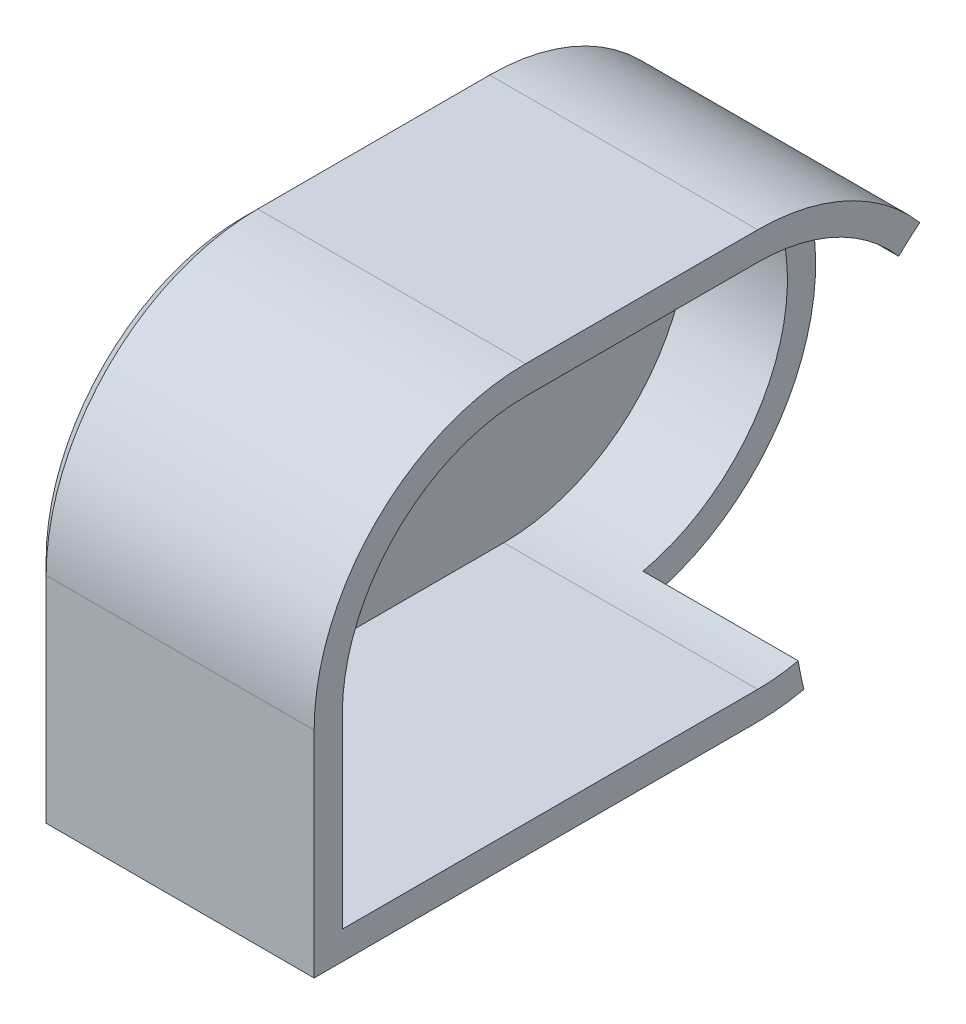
ISO-10303-21;
HEADER;
FILE_DESCRIPTION(('STEP AP214'),'2;1');
FILE_NAME('part.step','',(''),(''),'','','');
FILE_SCHEMA(('AUTOMOTIVE_DESIGN { 1 0 10303 214 1 1 1 1 }'));
ENDSEC;
DATA;
#1=APPLICATION_CONTEXT('core data for automotive mechanical design processes');
#2=APPLICATION_PROTOCOL_DEFINITION('international standard','automotive_design',2000,#1);
#3=PRODUCT_CONTEXT('',#1,'mechanical');
#4=PRODUCT('Part','Part','',(#3));
#5=PRODUCT_RELATED_PRODUCT_CATEGORY('part','',(#4));
#6=PRODUCT_DEFINITION_FORMATION('','',#4);
#7=PRODUCT_DEFINITION_CONTEXT('part definition',#1,'design');
#8=PRODUCT_DEFINITION('design','',#6,#7);
#9=PRODUCT_DEFINITION_SHAPE('','',#8);
#10=(LENGTH_UNIT() NAMED_UNIT(*) SI_UNIT(.MILLI.,.METRE.));
#11=(NAMED_UNIT(*) PLANE_ANGLE_UNIT() SI_UNIT($,.RADIAN.));
#12=(NAMED_UNIT(*) SI_UNIT($,.STERADIAN.) SOLID_ANGLE_UNIT());
#13=UNCERTAINTY_MEASURE_WITH_UNIT(LENGTH_MEASURE(1.E-05),#10,'distance_accuracy_value','');
#14=(GEOMETRIC_REPRESENTATION_CONTEXT(3) GLOBAL_UNCERTAINTY_ASSIGNED_CONTEXT((#13)) GLOBAL_UNIT_ASSIGNED_CONTEXT((#10,
#11,#12)) REPRESENTATION_CONTEXT('',''));
#15=CARTESIAN_POINT('',(0.,0.,0.));
#16=DIRECTION('',(0.,0.,1.));
#17=DIRECTION('',(1.,0.,0.));
#18=AXIS2_PLACEMENT_3D('',#15,#16,#17);
#19=CARTESIAN_POINT('',(-8.,0.,-300.));
#20=DIRECTION('',(-1.,0.,0.));
#21=DIRECTION('',(0.,0.,1.));
#22=AXIS2_PLACEMENT_3D('',#19,#20,#21);
#23=PLANE('',#22);
#24=CARTESIAN_POINT('',(-7.99999999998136,8.88991235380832,-273.448739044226));
#25=DIRECTION('',(-1.,0.,0.));
#26=DIRECTION('',(0.,0.,1.));
#27=AXIS2_PLACEMENT_3D('',#24,#25,#26);
#28=CIRCLE('',#27,15.1100876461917);
#29=CARTESIAN_POINT('',(-8.,18.6927535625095,-284.947393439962));
#30=VERTEX_POINT('',#29);
#31=CARTESIAN_POINT('',(-7.99999999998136,24.,-273.448739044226));
#32=VERTEX_POINT('',#31);
#33=EDGE_CURVE('E223',#30,#32,#28,.F.);
#34=ORIENTED_EDGE('',*,*,#33,.T.);
#35=DIRECTION('',(0.,0.,1.));
#36=VECTOR('',#35,1.);
#37=CARTESIAN_POINT('',(-7.99999999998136,24.,-257.));
#38=LINE('',#37,#36);
#39=CARTESIAN_POINT('',(-7.99999999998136,24.,-257.));
#40=VERTEX_POINT('',#39);
#41=EDGE_CURVE('E219',#32,#40,#38,.T.);
#42=ORIENTED_EDGE('',*,*,#41,.T.);
#43=CARTESIAN_POINT('',(-7.99999999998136,9.00000000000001,-257.));
#44=DIRECTION('',(-1.,0.,0.));
#45=DIRECTION('',(0.,0.,1.));
#46=AXIS2_PLACEMENT_3D('',#43,#44,#45);
#47=CIRCLE('',#46,15.);
#48=CARTESIAN_POINT('',(-7.99999999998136,9.00000000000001,-242.));
#49=VERTEX_POINT('',#48);
#50=EDGE_CURVE('E215',#40,#49,#47,.F.);
#51=ORIENTED_EDGE('',*,*,#50,.T.);
#52=DIRECTION('',(0.,-1.,0.));
#53=VECTOR('',#52,1.);
#54=CARTESIAN_POINT('',(-7.99999999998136,-6.22017529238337,-242.));
#55=LINE('',#54,#53);
#56=CARTESIAN_POINT('',(-7.99999999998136,-6.22017529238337,-242.));
#57=VERTEX_POINT('',#56);
#58=EDGE_CURVE('E237',#49,#57,#55,.T.);
#59=ORIENTED_EDGE('',*,*,#58,.T.);
#60=DIRECTION('',(0.,0.,-1.));
#61=VECTOR('',#60,1.);
#62=CARTESIAN_POINT('',(-7.99999999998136,-6.22017529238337,-273.448739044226));
#63=LINE('',#62,#61);
#64=CARTESIAN_POINT('',(-7.99999999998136,-6.22017529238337,-273.448739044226));
#65=VERTEX_POINT('',#64);
#66=EDGE_CURVE('E234',#57,#65,#63,.T.);
#67=ORIENTED_EDGE('',*,*,#66,.T.);
#68=CARTESIAN_POINT('',(-8.,-5.86037767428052,-276.726496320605));
#69=VERTEX_POINT('',#68);
#70=EDGE_CURVE('E222',#65,#69,#28,.F.);
#71=ORIENTED_EDGE('',*,*,#70,.T.);
#72=CARTESIAN_POINT('',(-8.,0.,-300.));
#73=DIRECTION('',(1.,0.,0.));
#74=DIRECTION('',(0.,0.,1.));
#75=AXIS2_PLACEMENT_3D('',#72,#73,#74);
#76=CIRCLE('',#75,24.);
#77=CARTESIAN_POINT('',(-8.,-3.90204206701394,-276.319331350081));
#78=VERTEX_POINT('',#77);
#79=EDGE_CURVE('E245',#78,#69,#76,.T.);
#80=ORIENTED_EDGE('',*,*,#79,.F.);
#81=CARTESIAN_POINT('',(-7.99999999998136,8.88991235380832,-273.448739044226));
#82=DIRECTION('',(-1.,0.,0.));
#83=DIRECTION('',(0.,0.,1.));
#84=AXIS2_PLACEMENT_3D('',#81,#82,#83);
#85=CIRCLE('',#84,13.1100876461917);
#86=CARTESIAN_POINT('',(-7.99999999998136,-4.22017529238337,-273.448739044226));
#87=VERTEX_POINT('',#86);
#88=EDGE_CURVE('E214',#87,#78,#85,.F.);
#89=ORIENTED_EDGE('',*,*,#88,.F.);
#90=DIRECTION('',(0.,0.,-1.));
#91=VECTOR('',#90,1.);
#92=CARTESIAN_POINT('',(-7.99999999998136,-4.22017529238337,-273.448739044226));
#93=LINE('',#92,#91);
#94=CARTESIAN_POINT('',(-7.99999999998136,-4.22017529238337,-244.));
#95=VERTEX_POINT('',#94);
#96=EDGE_CURVE('E522',#95,#87,#93,.T.);
#97=ORIENTED_EDGE('',*,*,#96,.F.);
#98=DIRECTION('',(0.,-1.,0.));
#99=VECTOR('',#98,1.);
#100=CARTESIAN_POINT('',(-7.99999999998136,-6.22017529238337,-244.));
#101=LINE('',#100,#99);
#102=CARTESIAN_POINT('',(-7.99999999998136,9.00000000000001,-244.));
#103=VERTEX_POINT('',#102);
#104=EDGE_CURVE('E524',#103,#95,#101,.T.);
#105=ORIENTED_EDGE('',*,*,#104,.F.);
#106=CARTESIAN_POINT('',(-7.99999999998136,9.00000000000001,-257.));
#107=DIRECTION('',(-1.,0.,0.));
#108=DIRECTION('',(0.,0.,1.));
#109=AXIS2_PLACEMENT_3D('',#106,#107,#108);
#110=CIRCLE('',#109,13.);
#111=CARTESIAN_POINT('',(-7.99999999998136,22.,-257.));
#112=VERTEX_POINT('',#111);
#113=EDGE_CURVE('E218',#112,#103,#110,.F.);
#114=ORIENTED_EDGE('',*,*,#113,.F.);
#115=DIRECTION('',(0.,0.,1.));
#116=VECTOR('',#115,1.);
#117=CARTESIAN_POINT('',(-7.99999999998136,22.,-257.));
#118=LINE('',#117,#116);
#119=CARTESIAN_POINT('',(-7.99999999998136,22.,-273.448739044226));
#120=VERTEX_POINT('',#119);
#121=EDGE_CURVE('E167',#120,#112,#118,.T.);
#122=ORIENTED_EDGE('',*,*,#121,.F.);
#123=CARTESIAN_POINT('',(-8.,17.3744049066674,-283.44312667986));
#124=VERTEX_POINT('',#123);
#125=EDGE_CURVE('E211',#124,#120,#85,.F.);
#126=ORIENTED_EDGE('',*,*,#125,.F.);
#127=EDGE_CURVE('E244',#30,#124,#76,.T.);
#128=ORIENTED_EDGE('',*,*,#127,.F.);
#129=EDGE_LOOP('',(#34,#42,#51,#59,#67,#71,#80,#89,#97,#105,#114,#122,#126,#128));
#130=FACE_BOUND('',#129,.T.);
#131=ADVANCED_FACE('F33',(#130),#23,.F.);
#132=CARTESIAN_POINT('',(-17.,0.,-300.));
#133=DIRECTION('',(-1.,0.,0.));
#134=DIRECTION('',(0.,0.,-1.));
#135=AXIS2_PLACEMENT_3D('',#132,#133,#134);
#136=CYLINDRICAL_SURFACE('',#135,24.);
#137=DIRECTION('',(-1.,0.,0.));
#138=VECTOR('',#137,1.);
#139=CARTESIAN_POINT('',(0.,18.6927535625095,-284.947393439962));
#140=LINE('',#139,#138);
#141=CARTESIAN_POINT('',(-19.,18.6927535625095,-284.947393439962));
#142=VERTEX_POINT('',#141);
#143=EDGE_CURVE('E227',#142,#30,#140,.F.);
#144=ORIENTED_EDGE('',*,*,#143,.T.);
#145=ORIENTED_EDGE('',*,*,#127,.T.);
#146=DIRECTION('',(-1.,0.,0.));
#147=VECTOR('',#146,1.);
#148=CARTESIAN_POINT('',(0.,17.3744049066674,-283.44312667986));
#149=LINE('',#148,#147);
#150=CARTESIAN_POINT('',(-19.,17.3744049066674,-283.44312667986));
#151=VERTEX_POINT('',#150);
#152=EDGE_CURVE('E208',#151,#124,#149,.F.);
#153=ORIENTED_EDGE('',*,*,#152,.F.);
#154=CARTESIAN_POINT('',(-19.,0.,-300.));
#155=DIRECTION('',(1.,0.,0.));
#156=DIRECTION('',(0.,0.,-1.));
#157=AXIS2_PLACEMENT_3D('',#154,#155,#156);
#158=CIRCLE('',#157,24.);
#159=EDGE_CURVE('E240',#142,#151,#158,.T.);
#160=ORIENTED_EDGE('',*,*,#159,.F.);
#161=EDGE_LOOP('',(#144,#145,#153,#160));
#162=FACE_BOUND('',#161,.T.);
#163=ADVANCED_FACE('F331',(#162),#136,.F.);
#164=DIRECTION('',(-1.,0.,0.));
#165=VECTOR('',#164,1.);
#166=CARTESIAN_POINT('',(0.,-5.86037767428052,-276.726496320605));
#167=LINE('',#166,#165);
#168=CARTESIAN_POINT('',(-19.0000000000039,-5.86037767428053,-276.726496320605));
#169=VERTEX_POINT('',#168);
#170=EDGE_CURVE('E228',#69,#169,#167,.T.);
#171=ORIENTED_EDGE('',*,*,#170,.T.);
#172=CARTESIAN_POINT('',(-19.0000000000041,-3.90204206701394,-276.319331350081));
#173=VERTEX_POINT('',#172);
#174=EDGE_CURVE('E241',#173,#169,#158,.T.);
#175=ORIENTED_EDGE('',*,*,#174,.F.);
#176=DIRECTION('',(-1.,0.,0.));
#177=VECTOR('',#176,1.);
#178=CARTESIAN_POINT('',(0.,-3.90204206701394,-276.319331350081));
#179=LINE('',#178,#177);
#180=EDGE_CURVE('E212',#78,#173,#179,.T.);
#181=ORIENTED_EDGE('',*,*,#180,.F.);
#182=ORIENTED_EDGE('',*,*,#79,.T.);
#183=EDGE_LOOP('',(#171,#175,#181,#182));
#184=FACE_BOUND('',#183,.T.);
#185=ADVANCED_FACE('F323',(#184),#136,.F.);
#186=CARTESIAN_POINT('',(-19.,0.,-300.));
#187=DIRECTION('',(-1.,0.,0.));
#188=DIRECTION('',(0.,0.,-1.));
#189=AXIS2_PLACEMENT_3D('',#186,#187,#188);
#190=PLANE('',#189);
#191=CARTESIAN_POINT('',(-19.0000000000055,8.88991235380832,-273.448739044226));
#192=DIRECTION('',(-1.,0.,0.));
#193=DIRECTION('',(0.,0.,1.));
#194=AXIS2_PLACEMENT_3D('',#191,#192,#193);
#195=CIRCLE('',#194,15.1100876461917);
#196=EDGE_CURVE('E226',#169,#142,#195,.F.);
#197=ORIENTED_EDGE('',*,*,#196,.T.);
#198=ORIENTED_EDGE('',*,*,#159,.T.);
#199=CARTESIAN_POINT('',(-19.0000000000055,8.88991235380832,-273.448739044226));
#200=DIRECTION('',(-1.,0.,0.));
#201=DIRECTION('',(0.,0.,1.));
#202=AXIS2_PLACEMENT_3D('',#199,#200,#201);
#203=CIRCLE('',#202,13.1100876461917);
#204=EDGE_CURVE('E178',#173,#151,#203,.F.);
#205=ORIENTED_EDGE('',*,*,#204,.F.);
#206=ORIENTED_EDGE('',*,*,#174,.T.);
#207=EDGE_LOOP('',(#197,#198,#205,#206));
#208=FACE_BOUND('',#207,.T.);
#209=ADVANCED_FACE('F315',(#208),#190,.F.);
#210=CARTESIAN_POINT('',(500000.,24.,-257.));
#211=DIRECTION('',(0.,1.,0.));
#212=DIRECTION('',(0.,0.,1.));
#213=AXIS2_PLACEMENT_3D('',#210,#211,#212);
#214=PLANE('',#213);
#215=DIRECTION('',(-1.,0.,0.));
#216=VECTOR('',#215,1.);
#217=CARTESIAN_POINT('',(500000.,24.,-273.448739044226));
#218=LINE('',#217,#216);
#219=CARTESIAN_POINT('',(-26.9999999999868,24.,-273.448739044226));
#220=VERTEX_POINT('',#219);
#221=EDGE_CURVE('E204',#32,#220,#218,.T.);
#222=ORIENTED_EDGE('',*,*,#221,.T.);
#223=DIRECTION('',(0.,0.,1.));
#224=VECTOR('',#223,1.);
#225=CARTESIAN_POINT('',(-26.9999999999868,24.,-257.));
#226=LINE('',#225,#224);
#227=CARTESIAN_POINT('',(-26.9999999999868,24.,-257.));
#228=VERTEX_POINT('',#227);
#229=EDGE_CURVE('E42',#220,#228,#226,.T.);
#230=ORIENTED_EDGE('',*,*,#229,.T.);
#231=DIRECTION('',(-1.,0.,0.));
#232=VECTOR('',#231,1.);
#233=CARTESIAN_POINT('',(500000.,24.,-257.));
#234=LINE('',#233,#232);
#235=EDGE_CURVE('E206',#40,#228,#234,.T.);
#236=ORIENTED_EDGE('',*,*,#235,.F.);
#237=ORIENTED_EDGE('',*,*,#41,.F.);
#238=EDGE_LOOP('',(#222,#230,#236,#237));
#239=FACE_BOUND('',#238,.T.);
#240=ADVANCED_FACE('F313',(#239),#214,.T.);
#241=CARTESIAN_POINT('',(500000.,8.88991235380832,-273.448739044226));
#242=DIRECTION('',(-1.,0.,0.));
#243=DIRECTION('',(0.,0.,1.));
#244=AXIS2_PLACEMENT_3D('',#241,#242,#243);
#245=CYLINDRICAL_SURFACE('',#244,15.1100876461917);
#246=DIRECTION('',(-1.,0.,0.));
#247=VECTOR('',#246,1.);
#248=CARTESIAN_POINT('',(500000.,-6.22017529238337,-273.448739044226));
#249=LINE('',#248,#247);
#250=CARTESIAN_POINT('',(-26.9999999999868,-6.22017529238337,-273.448739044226));
#251=VERTEX_POINT('',#250);
#252=EDGE_CURVE('E202',#65,#251,#249,.T.);
#253=ORIENTED_EDGE('',*,*,#252,.T.);
#254=CARTESIAN_POINT('',(-26.9999999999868,8.88991235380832,-273.448739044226));
#255=DIRECTION('',(-1.,0.,0.));
#256=DIRECTION('',(0.,0.,1.));
#257=AXIS2_PLACEMENT_3D('',#254,#255,#256);
#258=CIRCLE('',#257,15.1100876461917);
#259=EDGE_CURVE('E57',#251,#220,#258,.F.);
#260=ORIENTED_EDGE('',*,*,#259,.T.);
#261=ORIENTED_EDGE('',*,*,#221,.F.);
#262=ORIENTED_EDGE('',*,*,#33,.F.);
#263=ORIENTED_EDGE('',*,*,#143,.F.);
#264=ORIENTED_EDGE('',*,*,#196,.F.);
#265=ORIENTED_EDGE('',*,*,#170,.F.);
#266=ORIENTED_EDGE('',*,*,#70,.F.);
#267=EDGE_LOOP('',(#253,#260,#261,#262,#263,#264,#265,#266));
#268=FACE_BOUND('',#267,.T.);
#269=ADVANCED_FACE('F307',(#268),#245,.T.);
#270=CARTESIAN_POINT('',(500000.,-6.22017529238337,-244.));
#271=DIRECTION('',(0.,0.,1.));
#272=DIRECTION('',(1.,0.,0.));
#273=AXIS2_PLACEMENT_3D('',#270,#271,#272);
#274=PLANE('',#273);
#275=DIRECTION('',(-1.,0.,0.));
#276=VECTOR('',#275,1.);
#277=CARTESIAN_POINT('',(500000.,9.00000000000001,-244.));
#278=LINE('',#277,#276);
#279=CARTESIAN_POINT('',(-26.0000000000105,9.00000000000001,-244.));
#280=VERTEX_POINT('',#279);
#281=EDGE_CURVE('E174',#103,#280,#278,.T.);
#282=ORIENTED_EDGE('',*,*,#281,.F.);
#283=ORIENTED_EDGE('',*,*,#104,.T.);
#284=DIRECTION('',(-1.,0.,0.));
#285=VECTOR('',#284,1.);
#286=CARTESIAN_POINT('',(500000.,-4.22017529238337,-244.));
#287=LINE('',#286,#285);
#288=CARTESIAN_POINT('',(-26.0000000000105,-4.22017529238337,-244.));
#289=VERTEX_POINT('',#288);
#290=EDGE_CURVE('E192',#95,#289,#287,.T.);
#291=ORIENTED_EDGE('',*,*,#290,.T.);
#292=DIRECTION('',(0.,1.,0.));
#293=VECTOR('',#292,1.);
#294=CARTESIAN_POINT('',(-26.,-6.22017529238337,-244.));
#295=LINE('',#294,#293);
#296=EDGE_CURVE('E185',#289,#280,#295,.T.);
#297=ORIENTED_EDGE('',*,*,#296,.T.);
#298=EDGE_LOOP('',(#282,#283,#291,#297));
#299=FACE_BOUND('',#298,.T.);
#300=ADVANCED_FACE('F321',(#299),#274,.F.);
#301=CARTESIAN_POINT('',(500000.,-4.22017529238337,-273.448739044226));
#302=DIRECTION('',(0.,-1.,0.));
#303=DIRECTION('',(0.,0.,-1.));
#304=AXIS2_PLACEMENT_3D('',#301,#302,#303);
#305=PLANE('',#304);
#306=ORIENTED_EDGE('',*,*,#290,.F.);
#307=ORIENTED_EDGE('',*,*,#96,.T.);
#308=DIRECTION('',(-1.,0.,0.));
#309=VECTOR('',#308,1.);
#310=CARTESIAN_POINT('',(500000.,-4.22017529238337,-273.448739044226));
#311=LINE('',#310,#309);
#312=CARTESIAN_POINT('',(-26.0000000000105,-4.22017529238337,-273.448739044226));
#313=VERTEX_POINT('',#312);
#314=EDGE_CURVE('E189',#87,#313,#311,.T.);
#315=ORIENTED_EDGE('',*,*,#314,.T.);
#316=DIRECTION('',(0.,0.,1.));
#317=VECTOR('',#316,1.);
#318=CARTESIAN_POINT('',(-26.,-4.22017529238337,-273.448739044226));
#319=LINE('',#318,#317);
#320=EDGE_CURVE('E182',#313,#289,#319,.T.);
#321=ORIENTED_EDGE('',*,*,#320,.T.);
#322=EDGE_LOOP('',(#306,#307,#315,#321));
#323=FACE_BOUND('',#322,.T.);
#324=ADVANCED_FACE('F344',(#323),#305,.F.);
#325=CARTESIAN_POINT('',(500000.,-6.22017529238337,-273.448739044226));
#326=DIRECTION('',(0.,-1.,0.));
#327=DIRECTION('',(0.,0.,-1.));
#328=AXIS2_PLACEMENT_3D('',#325,#326,#327);
#329=PLANE('',#328);
#330=DIRECTION('',(-1.,0.,0.));
#331=VECTOR('',#330,1.);
#332=CARTESIAN_POINT('',(500000.,-6.22017529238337,-242.));
#333=LINE('',#332,#331);
#334=CARTESIAN_POINT('',(-26.9999999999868,-6.22017529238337,-242.));
#335=VERTEX_POINT('',#334);
#336=EDGE_CURVE('E199',#57,#335,#333,.T.);
#337=ORIENTED_EDGE('',*,*,#336,.T.);
#338=DIRECTION('',(0.,0.,-1.));
#339=VECTOR('',#338,1.);
#340=CARTESIAN_POINT('',(-26.9999999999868,-6.22017529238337,-273.448739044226));
#341=LINE('',#340,#339);
#342=EDGE_CURVE('E261',#335,#251,#341,.T.);
#343=ORIENTED_EDGE('',*,*,#342,.T.);
#344=ORIENTED_EDGE('',*,*,#252,.F.);
#345=ORIENTED_EDGE('',*,*,#66,.F.);
#346=EDGE_LOOP('',(#337,#343,#344,#345));
#347=FACE_BOUND('',#346,.T.);
#348=ADVANCED_FACE('F306',(#347),#329,.T.);
#349=CARTESIAN_POINT('',(500000.,9.00000000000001,-257.));
#350=DIRECTION('',(-1.,0.,0.));
#351=DIRECTION('',(0.,0.,1.));
#352=AXIS2_PLACEMENT_3D('',#349,#350,#351);
#353=CYLINDRICAL_SURFACE('',#352,15.);
#354=ORIENTED_EDGE('',*,*,#235,.T.);
#355=CARTESIAN_POINT('',(-26.9999999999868,9.00000000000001,-257.));
#356=DIRECTION('',(-1.,0.,0.));
#357=DIRECTION('',(0.,0.,1.));
#358=AXIS2_PLACEMENT_3D('',#355,#356,#357);
#359=CIRCLE('',#358,15.);
#360=CARTESIAN_POINT('',(-26.9999999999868,9.00000000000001,-242.));
#361=VERTEX_POINT('',#360);
#362=EDGE_CURVE('E11',#228,#361,#359,.F.);
#363=ORIENTED_EDGE('',*,*,#362,.T.);
#364=DIRECTION('',(-1.,0.,0.));
#365=VECTOR('',#364,1.);
#366=CARTESIAN_POINT('',(500000.,9.00000000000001,-242.));
#367=LINE('',#366,#365);
#368=EDGE_CURVE('E196',#49,#361,#367,.T.);
#369=ORIENTED_EDGE('',*,*,#368,.F.);
#370=ORIENTED_EDGE('',*,*,#50,.F.);
#371=EDGE_LOOP('',(#354,#363,#369,#370));
#372=FACE_BOUND('',#371,.T.);
#373=ADVANCED_FACE('F296',(#372),#353,.T.);
#374=CARTESIAN_POINT('',(500000.,-6.22017529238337,-242.));
#375=DIRECTION('',(0.,0.,1.));
#376=DIRECTION('',(1.,0.,0.));
#377=AXIS2_PLACEMENT_3D('',#374,#375,#376);
#378=PLANE('',#377);
#379=ORIENTED_EDGE('',*,*,#368,.T.);
#380=DIRECTION('',(0.,-1.,0.));
#381=VECTOR('',#380,1.);
#382=CARTESIAN_POINT('',(-26.9999999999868,-6.22017529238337,-242.));
#383=LINE('',#382,#381);
#384=EDGE_CURVE('E258',#361,#335,#383,.T.);
#385=ORIENTED_EDGE('',*,*,#384,.T.);
#386=ORIENTED_EDGE('',*,*,#336,.F.);
#387=ORIENTED_EDGE('',*,*,#58,.F.);
#388=EDGE_LOOP('',(#379,#385,#386,#387));
#389=FACE_BOUND('',#388,.T.);
#390=ADVANCED_FACE('F299',(#389),#378,.T.);
#391=CARTESIAN_POINT('',(500000.,9.00000000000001,-257.));
#392=DIRECTION('',(-1.,0.,0.));
#393=DIRECTION('',(0.,0.,1.));
#394=AXIS2_PLACEMENT_3D('',#391,#392,#393);
#395=CYLINDRICAL_SURFACE('',#394,13.);
#396=DIRECTION('',(-1.,0.,0.));
#397=VECTOR('',#396,1.);
#398=CARTESIAN_POINT('',(500000.,22.,-257.));
#399=LINE('',#398,#397);
#400=CARTESIAN_POINT('',(-26.0000000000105,22.,-257.));
#401=VERTEX_POINT('',#400);
#402=EDGE_CURVE('E164',#112,#401,#399,.T.);
#403=ORIENTED_EDGE('',*,*,#402,.F.);
#404=ORIENTED_EDGE('',*,*,#113,.T.);
#405=ORIENTED_EDGE('',*,*,#281,.T.);
#406=CARTESIAN_POINT('',(-26.,9.00000000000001,-257.));
#407=DIRECTION('',(-1.,0.,0.));
#408=DIRECTION('',(0.,0.,1.));
#409=AXIS2_PLACEMENT_3D('',#406,#407,#408);
#410=CIRCLE('',#409,13.);
#411=EDGE_CURVE('E155',#280,#401,#410,.T.);
#412=ORIENTED_EDGE('',*,*,#411,.T.);
#413=EDGE_LOOP('',(#403,#404,#405,#412));
#414=FACE_BOUND('',#413,.T.);
#415=ADVANCED_FACE('F172',(#414),#395,.F.);
#416=CARTESIAN_POINT('',(500000.,8.88991235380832,-273.448739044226));
#417=DIRECTION('',(-1.,0.,0.));
#418=DIRECTION('',(0.,0.,1.));
#419=AXIS2_PLACEMENT_3D('',#416,#417,#418);
#420=CYLINDRICAL_SURFACE('',#419,13.1100876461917);
#421=ORIENTED_EDGE('',*,*,#314,.F.);
#422=ORIENTED_EDGE('',*,*,#88,.T.);
#423=ORIENTED_EDGE('',*,*,#180,.T.);
#424=ORIENTED_EDGE('',*,*,#204,.T.);
#425=ORIENTED_EDGE('',*,*,#152,.T.);
#426=ORIENTED_EDGE('',*,*,#125,.T.);
#427=DIRECTION('',(-1.,0.,0.));
#428=VECTOR('',#427,1.);
#429=CARTESIAN_POINT('',(500000.,22.,-273.448739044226));
#430=LINE('',#429,#428);
#431=CARTESIAN_POINT('',(-26.,22.,-273.448739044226));
#432=VERTEX_POINT('',#431);
#433=EDGE_CURVE('E170',#120,#432,#430,.T.);
#434=ORIENTED_EDGE('',*,*,#433,.T.);
#435=CARTESIAN_POINT('',(-26.,8.88991235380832,-273.448739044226));
#436=DIRECTION('',(-1.,0.,0.));
#437=DIRECTION('',(0.,0.,1.));
#438=AXIS2_PLACEMENT_3D('',#435,#436,#437);
#439=CIRCLE('',#438,13.1100876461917);
#440=EDGE_CURVE('E158',#432,#313,#439,.T.);
#441=ORIENTED_EDGE('',*,*,#440,.T.);
#442=EDGE_LOOP('',(#421,#422,#423,#424,#425,#426,#434,#441));
#443=FACE_BOUND('',#442,.T.);
#444=ADVANCED_FACE('F356',(#443),#420,.F.);
#445=CARTESIAN_POINT('',(500000.,22.,-257.));
#446=DIRECTION('',(0.,1.,0.));
#447=DIRECTION('',(0.,0.,1.));
#448=AXIS2_PLACEMENT_3D('',#445,#446,#447);
#449=PLANE('',#448);
#450=ORIENTED_EDGE('',*,*,#433,.F.);
#451=ORIENTED_EDGE('',*,*,#121,.T.);
#452=ORIENTED_EDGE('',*,*,#402,.T.);
#453=DIRECTION('',(0.,0.,-1.));
#454=VECTOR('',#453,1.);
#455=CARTESIAN_POINT('',(-26.,22.,-257.));
#456=LINE('',#455,#454);
#457=EDGE_CURVE('E151',#401,#432,#456,.T.);
#458=ORIENTED_EDGE('',*,*,#457,.T.);
#459=EDGE_LOOP('',(#450,#451,#452,#458));
#460=FACE_BOUND('',#459,.T.);
#461=ADVANCED_FACE('F165',(#460),#449,.F.);
#462=CARTESIAN_POINT('',(-26.,9.00000000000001,-257.));
#463=DIRECTION('',(-1.,0.,0.));
#464=DIRECTION('',(0.,0.,1.));
#465=AXIS2_PLACEMENT_3D('',#462,#463,#464);
#466=PLANE('',#465);
#467=ORIENTED_EDGE('',*,*,#411,.F.);
#468=ORIENTED_EDGE('',*,*,#296,.F.);
#469=ORIENTED_EDGE('',*,*,#320,.F.);
#470=ORIENTED_EDGE('',*,*,#440,.F.);
#471=ORIENTED_EDGE('',*,*,#457,.F.);
#472=EDGE_LOOP('',(#467,#468,#469,#470,#471));
#473=FACE_BOUND('',#472,.T.);
#474=ADVANCED_FACE('F153',(#473),#466,.F.);
#475=CARTESIAN_POINT('',(-28.,9.00000000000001,-257.));
#476=DIRECTION('',(-1.,0.,0.));
#477=DIRECTION('',(0.,0.,1.));
#478=AXIS2_PLACEMENT_3D('',#475,#476,#477);
#479=PLANE('',#478);
#480=DIRECTION('',(0.,0.,1.));
#481=VECTOR('',#480,1.);
#482=CARTESIAN_POINT('',(-28.,-5.22017529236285,-257.));
#483=LINE('',#482,#481);
#484=CARTESIAN_POINT('',(-28.,-5.22017529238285,-273.448739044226));
#485=VERTEX_POINT('',#484);
#486=CARTESIAN_POINT('',(-28.,-5.22017529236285,-243.00000000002));
#487=VERTEX_POINT('',#486);
#488=EDGE_CURVE('E253',#485,#487,#483,.T.);
#489=ORIENTED_EDGE('',*,*,#488,.T.);
#490=DIRECTION('',(0.,1.,0.));
#491=VECTOR('',#490,1.);
#492=CARTESIAN_POINT('',(-28.,9.00000000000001,-243.00000000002));
#493=LINE('',#492,#491);
#494=CARTESIAN_POINT('',(-28.,9.00000000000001,-243.));
#495=VERTEX_POINT('',#494);
#496=EDGE_CURVE('E255',#487,#495,#493,.T.);
#497=ORIENTED_EDGE('',*,*,#496,.T.);
#498=CARTESIAN_POINT('',(-28.,9.00000000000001,-257.));
#499=DIRECTION('',(-1.,0.,0.));
#500=DIRECTION('',(0.,0.,1.));
#501=AXIS2_PLACEMENT_3D('',#498,#499,#500);
#502=CIRCLE('',#501,13.9999999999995);
#503=CARTESIAN_POINT('',(-28.,22.9999999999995,-257.));
#504=VERTEX_POINT('',#503);
#505=EDGE_CURVE('E186',#495,#504,#502,.T.);
#506=ORIENTED_EDGE('',*,*,#505,.T.);
#507=DIRECTION('',(0.,0.,-1.));
#508=VECTOR('',#507,1.);
#509=CARTESIAN_POINT('',(-28.,22.9999999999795,-257.));
#510=LINE('',#509,#508);
#511=CARTESIAN_POINT('',(-28.,22.9999999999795,-273.448739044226));
#512=VERTEX_POINT('',#511);
#513=EDGE_CURVE('E249',#504,#512,#510,.T.);
#514=ORIENTED_EDGE('',*,*,#513,.T.);
#515=CARTESIAN_POINT('',(-28.,8.88991235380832,-273.448739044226));
#516=DIRECTION('',(-1.,0.,0.));
#517=DIRECTION('',(0.,0.,1.));
#518=AXIS2_PLACEMENT_3D('',#515,#516,#517);
#519=CIRCLE('',#518,14.1100876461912);
#520=EDGE_CURVE('E251',#512,#485,#519,.T.);
#521=ORIENTED_EDGE('',*,*,#520,.T.);
#522=EDGE_LOOP('',(#489,#497,#506,#514,#521));
#523=FACE_BOUND('',#522,.T.);
#524=ADVANCED_FACE('F286',(#523),#479,.T.);
#525=CARTESIAN_POINT('',(-28.00000000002,8.88991235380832,-273.448739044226));
#526=DIRECTION('',(1.,0.,0.));
#527=DIRECTION('',(0.,0.,-1.));
#528=AXIS2_PLACEMENT_3D('',#525,#526,#527);
#529=CONICAL_SURFACE('',#528,14.1100876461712,0.785398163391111);
#530=DIRECTION('',(0.707106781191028,-0.707106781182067,0.));
#531=VECTOR('',#530,1.);
#532=CARTESIAN_POINT('',(-28.,-5.22017529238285,-273.448739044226));
#533=LINE('',#532,#531);
#534=EDGE_CURVE('E271',#485,#251,#533,.T.);
#535=ORIENTED_EDGE('',*,*,#534,.F.);
#536=ORIENTED_EDGE('',*,*,#520,.F.);
#537=DIRECTION('',(-0.707106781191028,-0.707106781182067,0.));
#538=VECTOR('',#537,1.);
#539=CARTESIAN_POINT('',(-26.9999999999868,24.,-273.448739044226));
#540=LINE('',#539,#538);
#541=EDGE_CURVE('E37',#220,#512,#540,.T.);
#542=ORIENTED_EDGE('',*,*,#541,.F.);
#543=ORIENTED_EDGE('',*,*,#259,.F.);
#544=EDGE_LOOP('',(#535,#536,#542,#543));
#545=FACE_BOUND('',#544,.T.);
#546=ADVANCED_FACE('F35',(#545),#529,.T.);
#547=CARTESIAN_POINT('',(-28.,22.9999999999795,-257.));
#548=DIRECTION('',(0.707106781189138,-0.707106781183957,0.));
#549=DIRECTION('',(0.707106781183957,0.707106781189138,0.));
#550=AXIS2_PLACEMENT_3D('',#547,#548,#549);
#551=PLANE('',#550);
#552=ORIENTED_EDGE('',*,*,#541,.T.);
#553=ORIENTED_EDGE('',*,*,#513,.F.);
#554=DIRECTION('',(-0.707106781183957,-0.707106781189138,0.));
#555=VECTOR('',#554,1.);
#556=CARTESIAN_POINT('',(-26.9999999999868,24.,-257.));
#557=LINE('',#556,#555);
#558=EDGE_CURVE('E269',#228,#504,#557,.T.);
#559=ORIENTED_EDGE('',*,*,#558,.F.);
#560=ORIENTED_EDGE('',*,*,#229,.F.);
#561=EDGE_LOOP('',(#552,#553,#559,#560));
#562=FACE_BOUND('',#561,.T.);
#563=ADVANCED_FACE('F281',(#562),#551,.F.);
#564=CARTESIAN_POINT('',(-28.,-5.22017529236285,-257.));
#565=DIRECTION('',(0.707106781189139,0.707106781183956,0.));
#566=DIRECTION('',(-0.707106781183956,0.707106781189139,0.));
#567=AXIS2_PLACEMENT_3D('',#564,#565,#566);
#568=PLANE('',#567);
#569=ORIENTED_EDGE('',*,*,#534,.T.);
#570=ORIENTED_EDGE('',*,*,#342,.F.);
#571=DIRECTION('',(-0.577350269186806,0.577350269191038,-0.577350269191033));
#572=VECTOR('',#571,1.);
#573=CARTESIAN_POINT('',(-32.6666666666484,-0.553508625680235,-247.666666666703));
#574=LINE('',#573,#572);
#575=EDGE_CURVE('E267',#487,#335,#574,.F.);
#576=ORIENTED_EDGE('',*,*,#575,.F.);
#577=ORIENTED_EDGE('',*,*,#488,.F.);
#578=EDGE_LOOP('',(#569,#570,#576,#577));
#579=FACE_BOUND('',#578,.T.);
#580=ADVANCED_FACE('F303',(#579),#568,.F.);
#581=CARTESIAN_POINT('',(-28.00000000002,9.00000000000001,-257.));
#582=DIRECTION('',(1.,0.,0.));
#583=DIRECTION('',(0.,0.,-1.));
#584=AXIS2_PLACEMENT_3D('',#581,#582,#583);
#585=CONICAL_SURFACE('',#584,13.9999999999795,0.78539816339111);
#586=ORIENTED_EDGE('',*,*,#558,.T.);
#587=ORIENTED_EDGE('',*,*,#505,.F.);
#588=DIRECTION('',(-0.707106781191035,0.,-0.70710678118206));
#589=VECTOR('',#588,1.);
#590=CARTESIAN_POINT('',(-26.9999999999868,9.00000000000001,-242.));
#591=LINE('',#590,#589);
#592=EDGE_CURVE('E265',#361,#495,#591,.T.);
#593=ORIENTED_EDGE('',*,*,#592,.F.);
#594=ORIENTED_EDGE('',*,*,#362,.F.);
#595=EDGE_LOOP('',(#586,#587,#593,#594));
#596=FACE_BOUND('',#595,.T.);
#597=ADVANCED_FACE('F292',(#596),#585,.T.);
#598=CARTESIAN_POINT('',(-28.,9.00000000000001,-243.00000000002));
#599=DIRECTION('',(0.707106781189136,0.,-0.707106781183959));
#600=DIRECTION('',(-0.707106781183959,0.,-0.707106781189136));
#601=AXIS2_PLACEMENT_3D('',#598,#599,#600);
#602=PLANE('',#601);
#603=ORIENTED_EDGE('',*,*,#575,.T.);
#604=ORIENTED_EDGE('',*,*,#384,.F.);
#605=ORIENTED_EDGE('',*,*,#592,.T.);
#606=ORIENTED_EDGE('',*,*,#496,.F.);
#607=EDGE_LOOP('',(#603,#604,#605,#606));
#608=FACE_BOUND('',#607,.T.);
#609=ADVANCED_FACE('F302',(#608),#602,.F.);
#610=CLOSED_SHELL('',(#131,#163,#185,#209,#240,#269,#300,#324,#348,#373,#390,#415,#444,#461,
#474,#524,#546,#563,#580,#597,#609));
#611=MANIFOLD_SOLID_BREP('B2',#610);
#612=ADVANCED_BREP_SHAPE_REPRESENTATION('',(#18,#611),#14);
#613=SHAPE_DEFINITION_REPRESENTATION(#9,#612);
ENDSEC;
END-ISO-10303-21;
